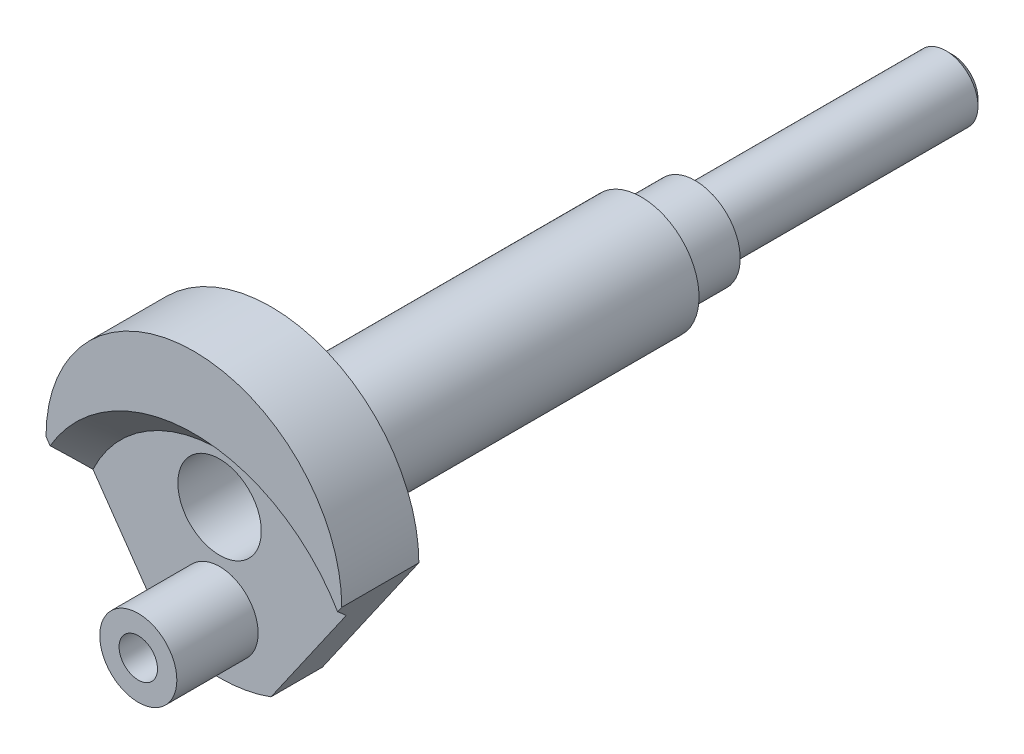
from build123d import *

# Parameters (mm, degrees)
CR1_R              = 24.3586
EXTRUDE1_DEPTH     = 12.7
SH3_W              = 3.183466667
SH3_H              = 13.388848
SH4_W              = 9.516533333
SH4_H              = 112.2172
CUT_EXTRUDE1_DEPTH = 12.869333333
CUT_EXTRUDE2_DEPTH = 12.869333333
NE1_W              = 51.223333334
NE1_H              = 2.1082
NE2_W              = 42.333333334
NE2_H              = 2.125133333
CHAMFER1_SIZE      = 1.0414


with BuildPart() as part:
    # CR1 → Extrude1 (new body)
    with BuildSketch(Plane(origin=(0, 0, 0), x_dir=(-1, 0, 0), z_dir=(0, 0, 1))):
        with Locations(Location((0, 0, 0), (0, 0, 180))):
            Circle(CR1_R)
    extrude(amount=EXTRUDE1_DEPTH)

    # CR2 → Cut-Revolve1 (revolve, cut)
    with BuildSketch(Plane(origin=(0, 0, 0), x_dir=(0, 0, 1), z_dir=(1, 0, 0))):
        Polygon((8.466666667, 14.816666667), (8.466666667, -8.212666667), (12.7, -12.615333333), (12.7, 14.816666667), align=None)
    revolve(axis=Axis((0, -14.816666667, 8.255), (0, 0, 1)), mode=Mode.SUBTRACT)

    # SH3 → Revolve1 (revolve)
    with BuildSketch(Plane(origin=(3.166533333, -14.816666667, 8.466666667), x_dir=(1, 0, 0), z_dir=(0, 1, 0))):
        with Locations((1.591733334, -6.694424)):
            Rectangle(SH3_W, SH3_H)
    revolve(axis=Axis((0, -14.816666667, 22.524957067), (0, 0, -1)))

    # SH4 → Revolve2 (revolve)
    with BuildSketch(Plane(origin=(0, 0, 0), x_dir=(-1, 0, 0), z_dir=(0, 1, 0)), mode=Mode.PRIVATE) as revolve2_sk:
        with Locations((4.758266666, -56.1086)):
            Rectangle(SH4_W, SH4_H)
    revolve(revolve2_sk.sketch.rotate(Axis((0, 0, -117.82806), (0, 0, 1)), 4.796773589), axis=Axis((0, 0, -117.82806), (0, 0, 1)))

    # HOLE1 → Cut-Revolve2 (revolve, cut)
    with BuildSketch(Plane(origin=(0, 0, 8.466666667), x_dir=(-1, 0, 0), z_dir=(0, 1, 0)), mode=Mode.PRIVATE) as cut_revolve2_sk:
        Polygon((0, 0), (6.874933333, 0), (6.874933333, -38.1), (0, -42.06924461), align=None)
    revolve(cut_revolve2_sk.sketch.rotate(Axis((0, 0, -35.706040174), (0, 0, 1)), 4.796773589), axis=Axis((0, 0, -35.706040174), (0, 0, 1)), mode=Mode.SUBTRACT)

    # CUT2 → Cut-Extrude1 (cut)
    with BuildSketch(Plane(origin=(0, 0, 0), x_dir=(1, 0, 0), z_dir=(0, 0, -1))):
        Polygon((-62.916045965, 125.430704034), (8.466666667, 22.839810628), (24.3586, 0), (95.741312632, -102.590893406), (300.923099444, 40.174531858), (142.265740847, 268.196129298), align=None)
    extrude(amount=-CUT_EXTRUDE1_DEPTH, mode=Mode.SUBTRACT)

    # Sketch9 → Cut-Extrude2 (cut)
    with BuildSketch(Plane(origin=(0, 0, 0), x_dir=(-1, 0, 0), z_dir=(0, 0, 1))):
        Polygon((-62.916045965, 125.430704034), (8.466666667, 22.839810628), (24.3586, 0), (95.741312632, -102.590893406), (300.923099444, 40.174531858), (142.265740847, 268.196129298), align=None)
    extrude(amount=CUT_EXTRUDE2_DEPTH, mode=Mode.SUBTRACT)

    # NE1 → Cut-Revolve3 (revolve, cut)
    with BuildSketch(Plane(origin=(0, 0, 0), x_dir=(0, 0, 1), z_dir=(1, 0, 0)), mode=Mode.PRIVATE) as cut_revolve3_sk:
        with Locations((-86.605533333, 8.462433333)):
            Rectangle(NE1_W, NE1_H)
    revolve(cut_revolve3_sk.sketch.rotate(Axis((0, 0, -114.778366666), (0, 0, 1)), 270), axis=Axis((0, 0, -114.778366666), (0, 0, 1)), mode=Mode.SUBTRACT)

    # NE2 → Cut-Revolve4 (revolve, cut)
    with BuildSketch(Plane(origin=(0, 0, 0), x_dir=(0, 0, 1), z_dir=(1, 0, 0)), mode=Mode.PRIVATE) as cut_revolve4_sk:
        with Locations((-91.050533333, 6.345766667)):
            Rectangle(NE2_W, NE2_H)
    revolve(cut_revolve4_sk.sketch.rotate(Axis((0, 0, -114.333866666), (0, 0, 1)), 270), axis=Axis((0, 0, -114.333866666), (0, 0, 1)), mode=Mode.SUBTRACT)

    # Chamfer1
    chamfer1_edges = [part.edges().sort_by_distance(p)[0] for p in [
        (5.2832, 0, -112.2172),
    ]]
    chamfer(chamfer1_edges, length=CHAMFER1_SIZE)


solid = part.part
